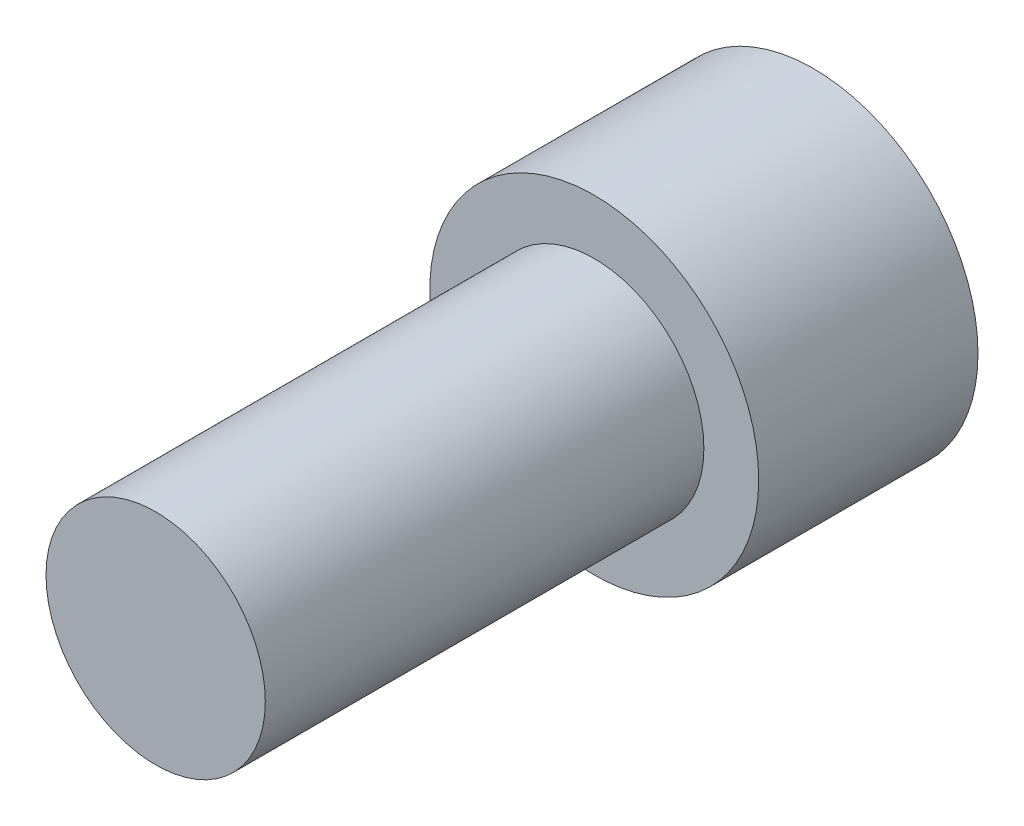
ISO-10303-21;
HEADER;
FILE_DESCRIPTION(('STEP AP214'),'2;1');
FILE_NAME('part.step','',(''),(''),'','','');
FILE_SCHEMA(('AUTOMOTIVE_DESIGN { 1 0 10303 214 1 1 1 1 }'));
ENDSEC;
DATA;
#1=APPLICATION_CONTEXT('core data for automotive mechanical design processes');
#2=APPLICATION_PROTOCOL_DEFINITION('international standard','automotive_design',2000,#1);
#3=PRODUCT_CONTEXT('',#1,'mechanical');
#4=PRODUCT('Part','Part','',(#3));
#5=PRODUCT_RELATED_PRODUCT_CATEGORY('part','',(#4));
#6=PRODUCT_DEFINITION_FORMATION('','',#4);
#7=PRODUCT_DEFINITION_CONTEXT('part definition',#1,'design');
#8=PRODUCT_DEFINITION('design','',#6,#7);
#9=PRODUCT_DEFINITION_SHAPE('','',#8);
#10=(LENGTH_UNIT() NAMED_UNIT(*) SI_UNIT(.MILLI.,.METRE.));
#11=(NAMED_UNIT(*) PLANE_ANGLE_UNIT() SI_UNIT($,.RADIAN.));
#12=(NAMED_UNIT(*) SI_UNIT($,.STERADIAN.) SOLID_ANGLE_UNIT());
#13=UNCERTAINTY_MEASURE_WITH_UNIT(LENGTH_MEASURE(1.E-05),#10,'distance_accuracy_value','');
#14=(GEOMETRIC_REPRESENTATION_CONTEXT(3) GLOBAL_UNCERTAINTY_ASSIGNED_CONTEXT((#13)) GLOBAL_UNIT_ASSIGNED_CONTEXT((#10,
#11,#12)) REPRESENTATION_CONTEXT('',''));
#15=CARTESIAN_POINT('',(0.,0.,0.));
#16=DIRECTION('',(0.,0.,1.));
#17=DIRECTION('',(1.,0.,0.));
#18=AXIS2_PLACEMENT_3D('',#15,#16,#17);
#19=CARTESIAN_POINT('',(0.,-9.525,-12.7));
#20=DIRECTION('',(0.,0.,-1.));
#21=DIRECTION('',(-1.,0.,0.));
#22=AXIS2_PLACEMENT_3D('',#19,#20,#21);
#23=PLANE('',#22);
#24=DIRECTION('',(0.866025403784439,-0.5,0.));
#25=VECTOR('',#24,1.);
#26=CARTESIAN_POINT('',(0.,5.49926131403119,-12.7));
#27=LINE('',#26,#25);
#28=CARTESIAN_POINT('',(0.,5.49926131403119,-12.7));
#29=VERTEX_POINT('',#28);
#30=CARTESIAN_POINT('',(4.7625,2.74963065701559,-12.7));
#31=VERTEX_POINT('',#30);
#32=EDGE_CURVE('E46',#29,#31,#27,.T.);
#33=ORIENTED_EDGE('',*,*,#32,.F.);
#34=DIRECTION('',(0.866025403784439,0.5,0.));
#35=VECTOR('',#34,1.);
#36=CARTESIAN_POINT('',(-4.7625,2.74963065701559,-12.7));
#37=LINE('',#36,#35);
#38=CARTESIAN_POINT('',(-4.7625,2.74963065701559,-12.7));
#39=VERTEX_POINT('',#38);
#40=EDGE_CURVE('E129',#39,#29,#37,.T.);
#41=ORIENTED_EDGE('',*,*,#40,.F.);
#42=DIRECTION('',(0.,1.,0.));
#43=VECTOR('',#42,1.);
#44=CARTESIAN_POINT('',(-4.7625,-2.74963065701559,-12.7));
#45=LINE('',#44,#43);
#46=CARTESIAN_POINT('',(-4.7625,-2.74963065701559,-12.7));
#47=VERTEX_POINT('',#46);
#48=EDGE_CURVE('E127',#47,#39,#45,.T.);
#49=ORIENTED_EDGE('',*,*,#48,.F.);
#50=DIRECTION('',(-0.866025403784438,0.5,0.));
#51=VECTOR('',#50,1.);
#52=CARTESIAN_POINT('',(0.,-5.49926131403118,-12.7));
#53=LINE('',#52,#51);
#54=CARTESIAN_POINT('',(0.,-5.49926131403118,-12.7));
#55=VERTEX_POINT('',#54);
#56=EDGE_CURVE('E94',#55,#47,#53,.T.);
#57=ORIENTED_EDGE('',*,*,#56,.F.);
#58=DIRECTION('',(-0.866025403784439,-0.5,0.));
#59=VECTOR('',#58,1.);
#60=CARTESIAN_POINT('',(4.7625,-2.74963065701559,-12.7));
#61=LINE('',#60,#59);
#62=CARTESIAN_POINT('',(4.7625,-2.74963065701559,-12.7));
#63=VERTEX_POINT('',#62);
#64=EDGE_CURVE('E123',#63,#55,#61,.T.);
#65=ORIENTED_EDGE('',*,*,#64,.F.);
#66=DIRECTION('',(0.,-1.,0.));
#67=VECTOR('',#66,1.);
#68=CARTESIAN_POINT('',(4.7625,2.74963065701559,-12.7));
#69=LINE('',#68,#67);
#70=EDGE_CURVE('E120',#31,#63,#69,.T.);
#71=ORIENTED_EDGE('',*,*,#70,.F.);
#72=EDGE_LOOP('',(#33,#41,#49,#57,#65,#71));
#73=FACE_BOUND('',#72,.T.);
#74=CARTESIAN_POINT('',(0.,0.,-12.7));
#75=DIRECTION('',(0.,0.,1.));
#76=DIRECTION('',(1.,0.,0.));
#77=AXIS2_PLACEMENT_3D('',#74,#75,#76);
#78=CIRCLE('',#77,9.525);
#79=CARTESIAN_POINT('',(9.525,0.,-12.7));
#80=VERTEX_POINT('',#79);
#81=EDGE_CURVE('E11',#80,#80,#78,.T.);
#82=ORIENTED_EDGE('',*,*,#81,.F.);
#83=EDGE_LOOP('',(#82));
#84=FACE_BOUND('',#83,.T.);
#85=ADVANCED_FACE('F32',(#73,#84),#23,.T.);
#86=CARTESIAN_POINT('',(0.,0.,25.4));
#87=DIRECTION('',(0.,0.,1.));
#88=DIRECTION('',(1.,0.,0.));
#89=AXIS2_PLACEMENT_3D('',#86,#87,#88);
#90=CYLINDRICAL_SURFACE('',#89,9.525);
#91=ORIENTED_EDGE('',*,*,#81,.T.);
#92=EDGE_LOOP('',(#91));
#93=FACE_BOUND('',#92,.T.);
#94=CARTESIAN_POINT('',(0.,0.,0.));
#95=DIRECTION('',(0.,0.,1.));
#96=DIRECTION('',(1.,0.,0.));
#97=AXIS2_PLACEMENT_3D('',#94,#95,#96);
#98=CIRCLE('',#97,9.525);
#99=CARTESIAN_POINT('',(9.525,0.,0.));
#100=VERTEX_POINT('',#99);
#101=EDGE_CURVE('E39',#100,#100,#98,.T.);
#102=ORIENTED_EDGE('',*,*,#101,.F.);
#103=EDGE_LOOP('',(#102));
#104=FACE_BOUND('',#103,.T.);
#105=ADVANCED_FACE('F149',(#93,#104),#90,.T.);
#106=CARTESIAN_POINT('',(0.,-6.35,0.));
#107=DIRECTION('',(0.,0.,1.));
#108=DIRECTION('',(1.,0.,0.));
#109=AXIS2_PLACEMENT_3D('',#106,#107,#108);
#110=PLANE('',#109);
#111=ORIENTED_EDGE('',*,*,#101,.T.);
#112=EDGE_LOOP('',(#111));
#113=FACE_BOUND('',#112,.T.);
#114=CARTESIAN_POINT('',(0.,0.,0.));
#115=DIRECTION('',(0.,0.,1.));
#116=DIRECTION('',(1.,0.,0.));
#117=AXIS2_PLACEMENT_3D('',#114,#115,#116);
#118=CIRCLE('',#117,6.35);
#119=CARTESIAN_POINT('',(6.35,0.,0.));
#120=VERTEX_POINT('',#119);
#121=EDGE_CURVE('E141',#120,#120,#118,.T.);
#122=ORIENTED_EDGE('',*,*,#121,.F.);
#123=EDGE_LOOP('',(#122));
#124=FACE_BOUND('',#123,.T.);
#125=ADVANCED_FACE('F146',(#113,#124),#110,.T.);
#126=CARTESIAN_POINT('',(0.,0.,25.4));
#127=DIRECTION('',(0.,0.,1.));
#128=DIRECTION('',(1.,0.,0.));
#129=AXIS2_PLACEMENT_3D('',#126,#127,#128);
#130=CYLINDRICAL_SURFACE('',#129,6.35);
#131=ORIENTED_EDGE('',*,*,#121,.T.);
#132=EDGE_LOOP('',(#131));
#133=FACE_BOUND('',#132,.T.);
#134=CARTESIAN_POINT('',(0.,0.,25.4));
#135=DIRECTION('',(0.,0.,1.));
#136=DIRECTION('',(1.,0.,0.));
#137=AXIS2_PLACEMENT_3D('',#134,#135,#136);
#138=CIRCLE('',#137,6.35);
#139=CARTESIAN_POINT('',(6.35,0.,25.4));
#140=VERTEX_POINT('',#139);
#141=EDGE_CURVE('E133',#140,#140,#138,.T.);
#142=ORIENTED_EDGE('',*,*,#141,.F.);
#143=EDGE_LOOP('',(#142));
#144=FACE_BOUND('',#143,.T.);
#145=ADVANCED_FACE('F156',(#133,#144),#130,.T.);
#146=CARTESIAN_POINT('',(0.,0.,25.4));
#147=DIRECTION('',(0.,0.,1.));
#148=DIRECTION('',(1.,0.,0.));
#149=AXIS2_PLACEMENT_3D('',#146,#147,#148);
#150=PLANE('',#149);
#151=ORIENTED_EDGE('',*,*,#141,.T.);
#152=EDGE_LOOP('',(#151));
#153=FACE_BOUND('',#152,.T.);
#154=ADVANCED_FACE('F162',(#153),#150,.T.);
#155=CARTESIAN_POINT('',(0.,5.49926131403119,-5.588));
#156=DIRECTION('',(0.5,0.866025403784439,0.));
#157=DIRECTION('',(-0.866025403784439,0.5,0.));
#158=AXIS2_PLACEMENT_3D('',#155,#156,#157);
#159=PLANE('',#158);
#160=ORIENTED_EDGE('',*,*,#32,.T.);
#161=DIRECTION('',(0.,0.,-1.));
#162=VECTOR('',#161,1.);
#163=CARTESIAN_POINT('',(4.7625,2.74963065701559,-5.588));
#164=LINE('',#163,#162);
#165=CARTESIAN_POINT('',(4.7625,2.74963065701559,-5.588));
#166=VERTEX_POINT('',#165);
#167=EDGE_CURVE('E76',#166,#31,#164,.T.);
#168=ORIENTED_EDGE('',*,*,#167,.F.);
#169=DIRECTION('',(0.866025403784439,-0.5,0.));
#170=VECTOR('',#169,1.);
#171=CARTESIAN_POINT('',(0.,5.49926131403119,-5.588));
#172=LINE('',#171,#170);
#173=CARTESIAN_POINT('',(0.,5.49926131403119,-5.588));
#174=VERTEX_POINT('',#173);
#175=EDGE_CURVE('E131',#174,#166,#172,.T.);
#176=ORIENTED_EDGE('',*,*,#175,.F.);
#177=DIRECTION('',(0.,0.,-1.));
#178=VECTOR('',#177,1.);
#179=CARTESIAN_POINT('',(0.,5.49926131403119,-5.588));
#180=LINE('',#179,#178);
#181=EDGE_CURVE('E54',#174,#29,#180,.T.);
#182=ORIENTED_EDGE('',*,*,#181,.T.);
#183=EDGE_LOOP('',(#160,#168,#176,#182));
#184=FACE_BOUND('',#183,.T.);
#185=ADVANCED_FACE('F166',(#184),#159,.F.);
#186=CARTESIAN_POINT('',(-4.7625,2.74963065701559,-5.588));
#187=DIRECTION('',(-0.5,0.866025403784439,0.));
#188=DIRECTION('',(-0.866025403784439,-0.5,0.));
#189=AXIS2_PLACEMENT_3D('',#186,#187,#188);
#190=PLANE('',#189);
#191=ORIENTED_EDGE('',*,*,#40,.T.);
#192=ORIENTED_EDGE('',*,*,#181,.F.);
#193=DIRECTION('',(0.866025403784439,0.5,0.));
#194=VECTOR('',#193,1.);
#195=CARTESIAN_POINT('',(-4.7625,2.74963065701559,-5.588));
#196=LINE('',#195,#194);
#197=CARTESIAN_POINT('',(-4.7625,2.74963065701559,-5.588));
#198=VERTEX_POINT('',#197);
#199=EDGE_CURVE('E106',#198,#174,#196,.T.);
#200=ORIENTED_EDGE('',*,*,#199,.F.);
#201=DIRECTION('',(0.,0.,-1.));
#202=VECTOR('',#201,1.);
#203=CARTESIAN_POINT('',(-4.7625,2.74963065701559,-5.588));
#204=LINE('',#203,#202);
#205=EDGE_CURVE('E98',#198,#39,#204,.T.);
#206=ORIENTED_EDGE('',*,*,#205,.T.);
#207=EDGE_LOOP('',(#191,#192,#200,#206));
#208=FACE_BOUND('',#207,.T.);
#209=ADVANCED_FACE('F170',(#208),#190,.F.);
#210=CARTESIAN_POINT('',(-4.7625,-2.74963065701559,-5.588));
#211=DIRECTION('',(-1.,0.,0.));
#212=DIRECTION('',(0.,-1.,0.));
#213=AXIS2_PLACEMENT_3D('',#210,#211,#212);
#214=PLANE('',#213);
#215=ORIENTED_EDGE('',*,*,#48,.T.);
#216=ORIENTED_EDGE('',*,*,#205,.F.);
#217=DIRECTION('',(0.,1.,0.));
#218=VECTOR('',#217,1.);
#219=CARTESIAN_POINT('',(-4.7625,-2.74963065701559,-5.588));
#220=LINE('',#219,#218);
#221=CARTESIAN_POINT('',(-4.7625,-2.74963065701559,-5.588));
#222=VERTEX_POINT('',#221);
#223=EDGE_CURVE('E102',#222,#198,#220,.T.);
#224=ORIENTED_EDGE('',*,*,#223,.F.);
#225=DIRECTION('',(0.,0.,-1.));
#226=VECTOR('',#225,1.);
#227=CARTESIAN_POINT('',(-4.7625,-2.74963065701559,-5.588));
#228=LINE('',#227,#226);
#229=EDGE_CURVE('E87',#222,#47,#228,.T.);
#230=ORIENTED_EDGE('',*,*,#229,.T.);
#231=EDGE_LOOP('',(#215,#216,#224,#230));
#232=FACE_BOUND('',#231,.T.);
#233=ADVANCED_FACE('F103',(#232),#214,.F.);
#234=CARTESIAN_POINT('',(0.,-5.49926131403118,-5.588));
#235=DIRECTION('',(-0.5,-0.866025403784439,0.));
#236=DIRECTION('',(0.866025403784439,-0.5,0.));
#237=AXIS2_PLACEMENT_3D('',#234,#235,#236);
#238=PLANE('',#237);
#239=ORIENTED_EDGE('',*,*,#56,.T.);
#240=ORIENTED_EDGE('',*,*,#229,.F.);
#241=DIRECTION('',(-0.866025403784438,0.5,0.));
#242=VECTOR('',#241,1.);
#243=CARTESIAN_POINT('',(0.,-5.49926131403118,-5.588));
#244=LINE('',#243,#242);
#245=CARTESIAN_POINT('',(0.,-5.49926131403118,-5.588));
#246=VERTEX_POINT('',#245);
#247=EDGE_CURVE('E91',#246,#222,#244,.T.);
#248=ORIENTED_EDGE('',*,*,#247,.F.);
#249=DIRECTION('',(0.,0.,-1.));
#250=VECTOR('',#249,1.);
#251=CARTESIAN_POINT('',(0.,-5.49926131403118,-5.588));
#252=LINE('',#251,#250);
#253=EDGE_CURVE('E99',#246,#55,#252,.T.);
#254=ORIENTED_EDGE('',*,*,#253,.T.);
#255=EDGE_LOOP('',(#239,#240,#248,#254));
#256=FACE_BOUND('',#255,.T.);
#257=ADVANCED_FACE('F89',(#256),#238,.F.);
#258=CARTESIAN_POINT('',(4.7625,-2.74963065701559,-5.588));
#259=DIRECTION('',(0.5,-0.866025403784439,0.));
#260=DIRECTION('',(0.866025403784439,0.5,0.));
#261=AXIS2_PLACEMENT_3D('',#258,#259,#260);
#262=PLANE('',#261);
#263=ORIENTED_EDGE('',*,*,#64,.T.);
#264=ORIENTED_EDGE('',*,*,#253,.F.);
#265=DIRECTION('',(-0.866025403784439,-0.5,0.));
#266=VECTOR('',#265,1.);
#267=CARTESIAN_POINT('',(4.7625,-2.74963065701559,-5.588));
#268=LINE('',#267,#266);
#269=CARTESIAN_POINT('',(4.7625,-2.74963065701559,-5.588));
#270=VERTEX_POINT('',#269);
#271=EDGE_CURVE('E112',#270,#246,#268,.T.);
#272=ORIENTED_EDGE('',*,*,#271,.F.);
#273=DIRECTION('',(0.,0.,-1.));
#274=VECTOR('',#273,1.);
#275=CARTESIAN_POINT('',(4.7625,-2.74963065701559,-5.588));
#276=LINE('',#275,#274);
#277=EDGE_CURVE('E136',#270,#63,#276,.T.);
#278=ORIENTED_EDGE('',*,*,#277,.T.);
#279=EDGE_LOOP('',(#263,#264,#272,#278));
#280=FACE_BOUND('',#279,.T.);
#281=ADVANCED_FACE('F174',(#280),#262,.F.);
#282=CARTESIAN_POINT('',(4.7625,2.74963065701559,-5.588));
#283=DIRECTION('',(1.,0.,0.));
#284=DIRECTION('',(0.,0.,-1.));
#285=AXIS2_PLACEMENT_3D('',#282,#283,#284);
#286=PLANE('',#285);
#287=ORIENTED_EDGE('',*,*,#70,.T.);
#288=ORIENTED_EDGE('',*,*,#277,.F.);
#289=DIRECTION('',(0.,-1.,0.));
#290=VECTOR('',#289,1.);
#291=CARTESIAN_POINT('',(4.7625,2.74963065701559,-5.588));
#292=LINE('',#291,#290);
#293=EDGE_CURVE('E114',#166,#270,#292,.T.);
#294=ORIENTED_EDGE('',*,*,#293,.F.);
#295=ORIENTED_EDGE('',*,*,#167,.T.);
#296=EDGE_LOOP('',(#287,#288,#294,#295));
#297=FACE_BOUND('',#296,.T.);
#298=ADVANCED_FACE('F171',(#297),#286,.F.);
#299=CARTESIAN_POINT('',(9.525,0.,-5.588));
#300=DIRECTION('',(0.,0.,-1.));
#301=DIRECTION('',(-1.,0.,0.));
#302=AXIS2_PLACEMENT_3D('',#299,#300,#301);
#303=PLANE('',#302);
#304=ORIENTED_EDGE('',*,*,#175,.T.);
#305=ORIENTED_EDGE('',*,*,#293,.T.);
#306=ORIENTED_EDGE('',*,*,#271,.T.);
#307=ORIENTED_EDGE('',*,*,#247,.T.);
#308=ORIENTED_EDGE('',*,*,#223,.T.);
#309=ORIENTED_EDGE('',*,*,#199,.T.);
#310=EDGE_LOOP('',(#304,#305,#306,#307,#308,#309));
#311=FACE_BOUND('',#310,.T.);
#312=ADVANCED_FACE('F109',(#311),#303,.T.);
#313=CLOSED_SHELL('',(#85,#105,#125,#145,#154,#185,#209,#233,#257,#281,#298,#312));
#314=MANIFOLD_SOLID_BREP('B2',#313);
#315=ADVANCED_BREP_SHAPE_REPRESENTATION('',(#18,#314),#14);
#316=SHAPE_DEFINITION_REPRESENTATION(#9,#315);
ENDSEC;
END-ISO-10303-21;
